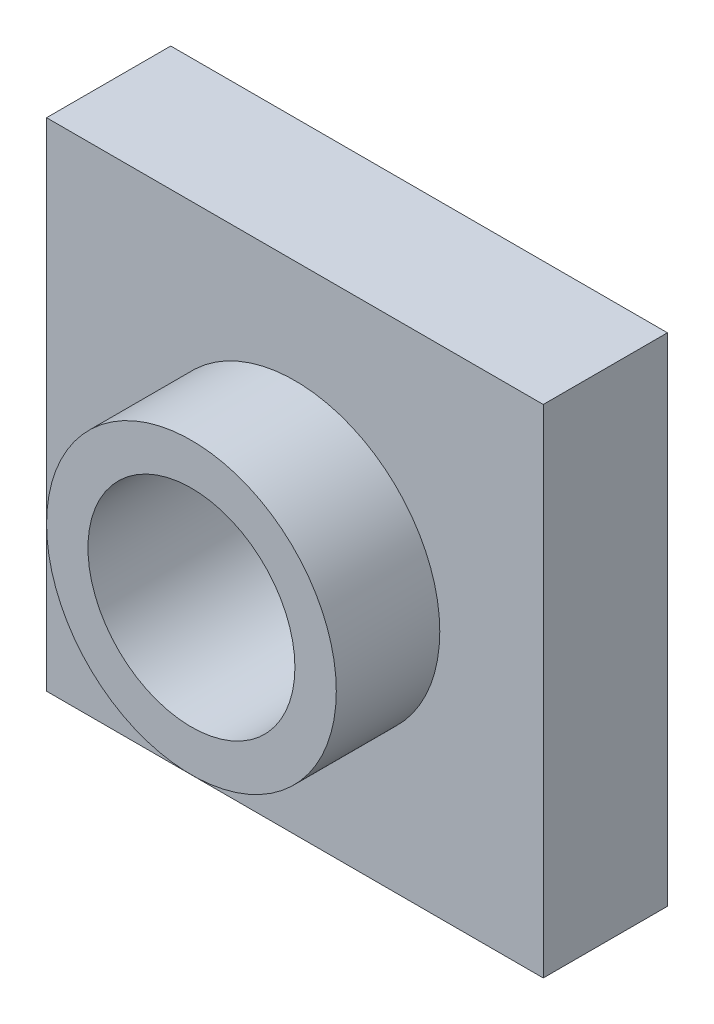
from build123d import *

# Parameters (mm, degrees)
SKETCH1_W           = 120
SKETCH1_H           = 120
BOSS_EXTRUDE1_DEPTH = 30
SKETCH2_R           = 35
BOSS_EXTRUDE2_DEPTH = 25
SKETCH3_R           = 25
CUT_EXTRUDE1_DEPTH  = 179.395627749


with BuildPart() as part:
    # Sketch1 → Boss-Extrude1 (new body)
    with BuildSketch(Plane.XY):
        with Locations((60, 60)):
            Rectangle(SKETCH1_W, SKETCH1_H)
    extrude(amount=BOSS_EXTRUDE1_DEPTH)

    # Sketch2 → Boss-Extrude2 (add)
    with BuildSketch(Plane.XY.offset(30)):
        with Locations(Location((60, 60, 0), (0, 0, 180))):
            Circle(SKETCH2_R)
    extrude(amount=BOSS_EXTRUDE2_DEPTH)

    # Sketch3 → Cut-Extrude1 (cut, through all)
    with BuildSketch(Plane.XY.offset(55)):
        with Locations((60, 60)):
            Circle(SKETCH3_R)
    extrude(amount=-CUT_EXTRUDE1_DEPTH, mode=Mode.SUBTRACT)


solid = part.part
